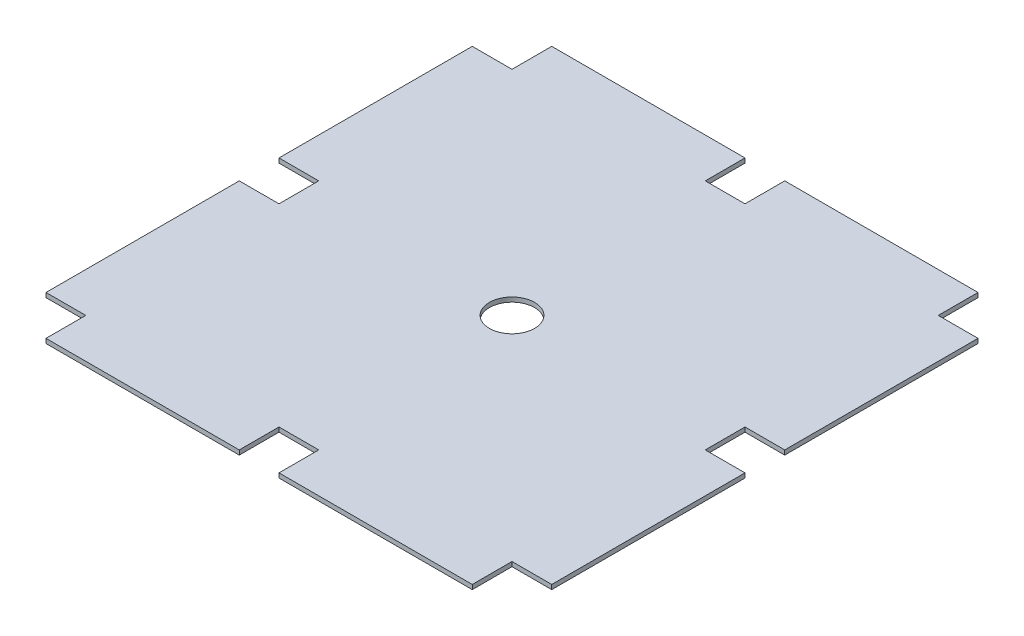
ISO-10303-21;
HEADER;
FILE_DESCRIPTION(('STEP AP214'),'2;1');
FILE_NAME('part.step','',(''),(''),'','','');
FILE_SCHEMA(('AUTOMOTIVE_DESIGN { 1 0 10303 214 1 1 1 1 }'));
ENDSEC;
DATA;
#1=APPLICATION_CONTEXT('core data for automotive mechanical design processes');
#2=APPLICATION_PROTOCOL_DEFINITION('international standard','automotive_design',2000,#1);
#3=PRODUCT_CONTEXT('',#1,'mechanical');
#4=PRODUCT('Part','Part','',(#3));
#5=PRODUCT_RELATED_PRODUCT_CATEGORY('part','',(#4));
#6=PRODUCT_DEFINITION_FORMATION('','',#4);
#7=PRODUCT_DEFINITION_CONTEXT('part definition',#1,'design');
#8=PRODUCT_DEFINITION('design','',#6,#7);
#9=PRODUCT_DEFINITION_SHAPE('','',#8);
#10=(LENGTH_UNIT() NAMED_UNIT(*) SI_UNIT(.MILLI.,.METRE.));
#11=(NAMED_UNIT(*) PLANE_ANGLE_UNIT() SI_UNIT($,.RADIAN.));
#12=(NAMED_UNIT(*) SI_UNIT($,.STERADIAN.) SOLID_ANGLE_UNIT());
#13=UNCERTAINTY_MEASURE_WITH_UNIT(LENGTH_MEASURE(1.E-05),#10,'distance_accuracy_value','');
#14=(GEOMETRIC_REPRESENTATION_CONTEXT(3) GLOBAL_UNCERTAINTY_ASSIGNED_CONTEXT((#13)) GLOBAL_UNIT_ASSIGNED_CONTEXT((#10,
#11,#12)) REPRESENTATION_CONTEXT('',''));
#15=CARTESIAN_POINT('',(0.,0.,0.));
#16=DIRECTION('',(0.,0.,1.));
#17=DIRECTION('',(1.,0.,0.));
#18=AXIS2_PLACEMENT_3D('',#15,#16,#17);
#19=CARTESIAN_POINT('',(-2.97741629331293E-13,3.175,-149.86));
#20=DIRECTION('',(0.,0.,-1.));
#21=DIRECTION('',(-1.,0.,0.));
#22=AXIS2_PLACEMENT_3D('',#19,#20,#21);
#23=PLANE('',#22);
#24=DIRECTION('',(1.,0.,0.));
#25=VECTOR('',#24,1.);
#26=CARTESIAN_POINT('',(-2.97741629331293E-13,0.,-149.86));
#27=LINE('',#26,#25);
#28=CARTESIAN_POINT('',(-13.97,0.,-149.86));
#29=VERTEX_POINT('',#28);
#30=CARTESIAN_POINT('',(13.97,0.,-149.86));
#31=VERTEX_POINT('',#30);
#32=EDGE_CURVE('E333',#29,#31,#27,.T.);
#33=ORIENTED_EDGE('',*,*,#32,.F.);
#34=DIRECTION('',(0.,-1.,0.));
#35=VECTOR('',#34,1.);
#36=CARTESIAN_POINT('',(-13.97,3.175,-149.86));
#37=LINE('',#36,#35);
#38=CARTESIAN_POINT('',(-13.97,3.175,-149.86));
#39=VERTEX_POINT('',#38);
#40=EDGE_CURVE('E11',#39,#29,#37,.T.);
#41=ORIENTED_EDGE('',*,*,#40,.F.);
#42=DIRECTION('',(1.,0.,0.));
#43=VECTOR('',#42,1.);
#44=CARTESIAN_POINT('',(-2.97741629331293E-13,3.175,-149.86));
#45=LINE('',#44,#43);
#46=CARTESIAN_POINT('',(13.97,3.175,-149.86));
#47=VERTEX_POINT('',#46);
#48=EDGE_CURVE('E255',#39,#47,#45,.T.);
#49=ORIENTED_EDGE('',*,*,#48,.T.);
#50=DIRECTION('',(0.,-1.,0.));
#51=VECTOR('',#50,1.);
#52=CARTESIAN_POINT('',(13.97,3.175,-149.86));
#53=LINE('',#52,#51);
#54=EDGE_CURVE('E145',#47,#31,#53,.T.);
#55=ORIENTED_EDGE('',*,*,#54,.T.);
#56=EDGE_LOOP('',(#33,#41,#49,#55));
#57=FACE_BOUND('',#56,.T.);
#58=ADVANCED_FACE('F34',(#57),#23,.T.);
#59=CARTESIAN_POINT('',(-13.9699999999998,3.175,0.));
#60=DIRECTION('',(1.,0.,0.));
#61=DIRECTION('',(0.,0.,-1.));
#62=AXIS2_PLACEMENT_3D('',#59,#60,#61);
#63=PLANE('',#62);
#64=DIRECTION('',(0.,0.,1.));
#65=VECTOR('',#64,1.);
#66=CARTESIAN_POINT('',(-13.9699999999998,0.,0.));
#67=LINE('',#66,#65);
#68=CARTESIAN_POINT('',(-13.97,0.,-177.8));
#69=VERTEX_POINT('',#68);
#70=EDGE_CURVE('E330',#69,#29,#67,.T.);
#71=ORIENTED_EDGE('',*,*,#70,.F.);
#72=DIRECTION('',(0.,-1.,0.));
#73=VECTOR('',#72,1.);
#74=CARTESIAN_POINT('',(-13.97,3.175,-177.8));
#75=LINE('',#74,#73);
#76=CARTESIAN_POINT('',(-13.97,3.175,-177.8));
#77=VERTEX_POINT('',#76);
#78=EDGE_CURVE('E43',#77,#69,#75,.T.);
#79=ORIENTED_EDGE('',*,*,#78,.F.);
#80=DIRECTION('',(0.,0.,1.));
#81=VECTOR('',#80,1.);
#82=CARTESIAN_POINT('',(-13.9699999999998,3.175,0.));
#83=LINE('',#82,#81);
#84=EDGE_CURVE('E250',#77,#39,#83,.T.);
#85=ORIENTED_EDGE('',*,*,#84,.T.);
#86=ORIENTED_EDGE('',*,*,#40,.T.);
#87=EDGE_LOOP('',(#71,#79,#85,#86));
#88=FACE_BOUND('',#87,.T.);
#89=ADVANCED_FACE('F331',(#88),#63,.T.);
#90=CARTESIAN_POINT('',(0.,3.175,-177.8));
#91=DIRECTION('',(0.,0.,-1.));
#92=DIRECTION('',(-1.,0.,0.));
#93=AXIS2_PLACEMENT_3D('',#90,#91,#92);
#94=PLANE('',#93);
#95=DIRECTION('',(1.,0.,0.));
#96=VECTOR('',#95,1.);
#97=CARTESIAN_POINT('',(0.,0.,-177.8));
#98=LINE('',#97,#96);
#99=CARTESIAN_POINT('',(-149.86,0.,-177.8));
#100=VERTEX_POINT('',#99);
#101=EDGE_CURVE('E269',#100,#69,#98,.T.);
#102=ORIENTED_EDGE('',*,*,#101,.F.);
#103=DIRECTION('',(0.,-1.,0.));
#104=VECTOR('',#103,1.);
#105=CARTESIAN_POINT('',(-149.86,3.175,-177.8));
#106=LINE('',#105,#104);
#107=CARTESIAN_POINT('',(-149.86,3.175,-177.8));
#108=VERTEX_POINT('',#107);
#109=EDGE_CURVE('E324',#108,#100,#106,.T.);
#110=ORIENTED_EDGE('',*,*,#109,.F.);
#111=DIRECTION('',(1.,0.,0.));
#112=VECTOR('',#111,1.);
#113=CARTESIAN_POINT('',(0.,3.175,-177.8));
#114=LINE('',#113,#112);
#115=EDGE_CURVE('E244',#108,#77,#114,.T.);
#116=ORIENTED_EDGE('',*,*,#115,.T.);
#117=ORIENTED_EDGE('',*,*,#78,.T.);
#118=EDGE_LOOP('',(#102,#110,#116,#117));
#119=FACE_BOUND('',#118,.T.);
#120=ADVANCED_FACE('F327',(#119),#94,.T.);
#121=CARTESIAN_POINT('',(-149.86,3.175,0.));
#122=DIRECTION('',(1.,0.,0.));
#123=DIRECTION('',(0.,0.,-1.));
#124=AXIS2_PLACEMENT_3D('',#121,#122,#123);
#125=PLANE('',#124);
#126=DIRECTION('',(0.,0.,1.));
#127=VECTOR('',#126,1.);
#128=CARTESIAN_POINT('',(-149.86,0.,0.));
#129=LINE('',#128,#127);
#130=CARTESIAN_POINT('',(-149.86,0.,-149.86));
#131=VERTEX_POINT('',#130);
#132=EDGE_CURVE('E339',#100,#131,#129,.T.);
#133=ORIENTED_EDGE('',*,*,#132,.T.);
#134=DIRECTION('',(0.,-1.,0.));
#135=VECTOR('',#134,1.);
#136=CARTESIAN_POINT('',(-149.86,3.175,-149.86));
#137=LINE('',#136,#135);
#138=CARTESIAN_POINT('',(-149.86,3.175,-149.86));
#139=VERTEX_POINT('',#138);
#140=EDGE_CURVE('E322',#139,#131,#137,.T.);
#141=ORIENTED_EDGE('',*,*,#140,.F.);
#142=DIRECTION('',(0.,0.,1.));
#143=VECTOR('',#142,1.);
#144=CARTESIAN_POINT('',(-149.86,3.175,0.));
#145=LINE('',#144,#143);
#146=EDGE_CURVE('E249',#108,#139,#145,.T.);
#147=ORIENTED_EDGE('',*,*,#146,.F.);
#148=ORIENTED_EDGE('',*,*,#109,.T.);
#149=EDGE_LOOP('',(#133,#141,#147,#148));
#150=FACE_BOUND('',#149,.T.);
#151=ADVANCED_FACE('F543',(#150),#125,.F.);
#152=CARTESIAN_POINT('',(1.48870814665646E-13,3.175,-149.86));
#153=DIRECTION('',(0.,0.,-1.));
#154=DIRECTION('',(-1.,0.,0.));
#155=AXIS2_PLACEMENT_3D('',#152,#153,#154);
#156=PLANE('',#155);
#157=DIRECTION('',(1.,0.,0.));
#158=VECTOR('',#157,1.);
#159=CARTESIAN_POINT('',(1.48870814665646E-13,0.,-149.86));
#160=LINE('',#159,#158);
#161=CARTESIAN_POINT('',(-177.8,0.,-149.86));
#162=VERTEX_POINT('',#161);
#163=EDGE_CURVE('E340',#162,#131,#160,.T.);
#164=ORIENTED_EDGE('',*,*,#163,.F.);
#165=DIRECTION('',(0.,-1.,0.));
#166=VECTOR('',#165,1.);
#167=CARTESIAN_POINT('',(-177.8,3.175,-149.86));
#168=LINE('',#167,#166);
#169=CARTESIAN_POINT('',(-177.8,3.175,-149.86));
#170=VERTEX_POINT('',#169);
#171=EDGE_CURVE('E320',#170,#162,#168,.T.);
#172=ORIENTED_EDGE('',*,*,#171,.F.);
#173=DIRECTION('',(1.,0.,0.));
#174=VECTOR('',#173,1.);
#175=CARTESIAN_POINT('',(1.48870814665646E-13,3.175,-149.86));
#176=LINE('',#175,#174);
#177=EDGE_CURVE('E253',#170,#139,#176,.T.);
#178=ORIENTED_EDGE('',*,*,#177,.T.);
#179=ORIENTED_EDGE('',*,*,#140,.T.);
#180=EDGE_LOOP('',(#164,#172,#178,#179));
#181=FACE_BOUND('',#180,.T.);
#182=ADVANCED_FACE('F463',(#181),#156,.T.);
#183=CARTESIAN_POINT('',(-177.8,3.175,0.));
#184=DIRECTION('',(-1.,0.,0.));
#185=DIRECTION('',(0.,0.,1.));
#186=AXIS2_PLACEMENT_3D('',#183,#184,#185);
#187=PLANE('',#186);
#188=DIRECTION('',(0.,0.,-1.));
#189=VECTOR('',#188,1.);
#190=CARTESIAN_POINT('',(-177.8,0.,0.));
#191=LINE('',#190,#189);
#192=CARTESIAN_POINT('',(-177.8,0.,-13.97));
#193=VERTEX_POINT('',#192);
#194=EDGE_CURVE('E345',#193,#162,#191,.T.);
#195=ORIENTED_EDGE('',*,*,#194,.F.);
#196=DIRECTION('',(0.,-1.,0.));
#197=VECTOR('',#196,1.);
#198=CARTESIAN_POINT('',(-177.8,3.175,-13.97));
#199=LINE('',#198,#197);
#200=CARTESIAN_POINT('',(-177.8,3.175,-13.97));
#201=VERTEX_POINT('',#200);
#202=EDGE_CURVE('E318',#201,#193,#199,.T.);
#203=ORIENTED_EDGE('',*,*,#202,.F.);
#204=DIRECTION('',(0.,0.,-1.));
#205=VECTOR('',#204,1.);
#206=CARTESIAN_POINT('',(-177.8,3.175,0.));
#207=LINE('',#206,#205);
#208=EDGE_CURVE('E456',#201,#170,#207,.T.);
#209=ORIENTED_EDGE('',*,*,#208,.T.);
#210=ORIENTED_EDGE('',*,*,#171,.T.);
#211=EDGE_LOOP('',(#195,#203,#209,#210));
#212=FACE_BOUND('',#211,.T.);
#213=ADVANCED_FACE('F469',(#212),#187,.T.);
#214=CARTESIAN_POINT('',(0.,3.175,-13.97));
#215=DIRECTION('',(0.,0.,-1.));
#216=DIRECTION('',(-1.,0.,0.));
#217=AXIS2_PLACEMENT_3D('',#214,#215,#216);
#218=PLANE('',#217);
#219=DIRECTION('',(1.,0.,0.));
#220=VECTOR('',#219,1.);
#221=CARTESIAN_POINT('',(0.,0.,-13.97));
#222=LINE('',#221,#220);
#223=CARTESIAN_POINT('',(-149.86,0.,-13.97));
#224=VERTEX_POINT('',#223);
#225=EDGE_CURVE('E348',#193,#224,#222,.T.);
#226=ORIENTED_EDGE('',*,*,#225,.T.);
#227=DIRECTION('',(0.,-1.,0.));
#228=VECTOR('',#227,1.);
#229=CARTESIAN_POINT('',(-149.86,3.175,-13.97));
#230=LINE('',#229,#228);
#231=CARTESIAN_POINT('',(-149.86,3.175,-13.97));
#232=VERTEX_POINT('',#231);
#233=EDGE_CURVE('E315',#232,#224,#230,.T.);
#234=ORIENTED_EDGE('',*,*,#233,.F.);
#235=DIRECTION('',(1.,0.,0.));
#236=VECTOR('',#235,1.);
#237=CARTESIAN_POINT('',(0.,3.175,-13.97));
#238=LINE('',#237,#236);
#239=EDGE_CURVE('E453',#201,#232,#238,.T.);
#240=ORIENTED_EDGE('',*,*,#239,.F.);
#241=ORIENTED_EDGE('',*,*,#202,.T.);
#242=EDGE_LOOP('',(#226,#234,#240,#241));
#243=FACE_BOUND('',#242,.T.);
#244=ADVANCED_FACE('F474',(#243),#218,.F.);
#245=CARTESIAN_POINT('',(-149.86,3.175,0.));
#246=DIRECTION('',(1.,0.,0.));
#247=DIRECTION('',(0.,0.,-1.));
#248=AXIS2_PLACEMENT_3D('',#245,#246,#247);
#249=PLANE('',#248);
#250=DIRECTION('',(0.,0.,1.));
#251=VECTOR('',#250,1.);
#252=CARTESIAN_POINT('',(-149.86,0.,0.));
#253=LINE('',#252,#251);
#254=CARTESIAN_POINT('',(-149.86,0.,13.97));
#255=VERTEX_POINT('',#254);
#256=EDGE_CURVE('E352',#224,#255,#253,.T.);
#257=ORIENTED_EDGE('',*,*,#256,.T.);
#258=DIRECTION('',(0.,-1.,0.));
#259=VECTOR('',#258,1.);
#260=CARTESIAN_POINT('',(-149.86,3.175,13.97));
#261=LINE('',#260,#259);
#262=CARTESIAN_POINT('',(-149.86,3.175,13.97));
#263=VERTEX_POINT('',#262);
#264=EDGE_CURVE('E313',#263,#255,#261,.T.);
#265=ORIENTED_EDGE('',*,*,#264,.F.);
#266=DIRECTION('',(0.,0.,1.));
#267=VECTOR('',#266,1.);
#268=CARTESIAN_POINT('',(-149.86,3.175,0.));
#269=LINE('',#268,#267);
#270=EDGE_CURVE('E451',#232,#263,#269,.T.);
#271=ORIENTED_EDGE('',*,*,#270,.F.);
#272=ORIENTED_EDGE('',*,*,#233,.T.);
#273=EDGE_LOOP('',(#257,#265,#271,#272));
#274=FACE_BOUND('',#273,.T.);
#275=ADVANCED_FACE('F480',(#274),#249,.F.);
#276=CARTESIAN_POINT('',(0.,3.175,13.97));
#277=DIRECTION('',(0.,0.,-1.));
#278=DIRECTION('',(-1.,0.,0.));
#279=AXIS2_PLACEMENT_3D('',#276,#277,#278);
#280=PLANE('',#279);
#281=DIRECTION('',(1.,0.,0.));
#282=VECTOR('',#281,1.);
#283=CARTESIAN_POINT('',(0.,0.,13.97));
#284=LINE('',#283,#282);
#285=CARTESIAN_POINT('',(-177.8,0.,13.97));
#286=VERTEX_POINT('',#285);
#287=EDGE_CURVE('E355',#286,#255,#284,.T.);
#288=ORIENTED_EDGE('',*,*,#287,.F.);
#289=DIRECTION('',(0.,-1.,0.));
#290=VECTOR('',#289,1.);
#291=CARTESIAN_POINT('',(-177.8,3.175,13.97));
#292=LINE('',#291,#290);
#293=CARTESIAN_POINT('',(-177.8,3.175,13.97));
#294=VERTEX_POINT('',#293);
#295=EDGE_CURVE('E311',#294,#286,#292,.T.);
#296=ORIENTED_EDGE('',*,*,#295,.F.);
#297=DIRECTION('',(1.,0.,0.));
#298=VECTOR('',#297,1.);
#299=CARTESIAN_POINT('',(0.,3.175,13.97));
#300=LINE('',#299,#298);
#301=EDGE_CURVE('E448',#294,#263,#300,.T.);
#302=ORIENTED_EDGE('',*,*,#301,.T.);
#303=ORIENTED_EDGE('',*,*,#264,.T.);
#304=EDGE_LOOP('',(#288,#296,#302,#303));
#305=FACE_BOUND('',#304,.T.);
#306=ADVANCED_FACE('F483',(#305),#280,.T.);
#307=CARTESIAN_POINT('',(-177.8,0.,149.86));
#308=VERTEX_POINT('',#307);
#309=EDGE_CURVE('E349',#308,#286,#191,.T.);
#310=ORIENTED_EDGE('',*,*,#309,.F.);
#311=DIRECTION('',(0.,-1.,0.));
#312=VECTOR('',#311,1.);
#313=CARTESIAN_POINT('',(-177.8,3.175,149.86));
#314=LINE('',#313,#312);
#315=CARTESIAN_POINT('',(-177.8,3.175,149.86));
#316=VERTEX_POINT('',#315);
#317=EDGE_CURVE('E309',#316,#308,#314,.T.);
#318=ORIENTED_EDGE('',*,*,#317,.F.);
#319=EDGE_CURVE('E447',#316,#294,#207,.T.);
#320=ORIENTED_EDGE('',*,*,#319,.T.);
#321=ORIENTED_EDGE('',*,*,#295,.T.);
#322=EDGE_LOOP('',(#310,#318,#320,#321));
#323=FACE_BOUND('',#322,.T.);
#324=ADVANCED_FACE('F487',(#323),#187,.T.);
#325=CARTESIAN_POINT('',(1.48870814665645E-13,3.175,149.86));
#326=DIRECTION('',(0.,0.,-1.));
#327=DIRECTION('',(-1.,0.,0.));
#328=AXIS2_PLACEMENT_3D('',#325,#326,#327);
#329=PLANE('',#328);
#330=DIRECTION('',(1.,0.,0.));
#331=VECTOR('',#330,1.);
#332=CARTESIAN_POINT('',(1.48870814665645E-13,0.,149.86));
#333=LINE('',#332,#331);
#334=CARTESIAN_POINT('',(-149.86,0.,149.86));
#335=VERTEX_POINT('',#334);
#336=EDGE_CURVE('E358',#308,#335,#333,.T.);
#337=ORIENTED_EDGE('',*,*,#336,.T.);
#338=DIRECTION('',(0.,-1.,0.));
#339=VECTOR('',#338,1.);
#340=CARTESIAN_POINT('',(-149.86,3.175,149.86));
#341=LINE('',#340,#339);
#342=CARTESIAN_POINT('',(-149.86,3.175,149.86));
#343=VERTEX_POINT('',#342);
#344=EDGE_CURVE('E307',#343,#335,#341,.T.);
#345=ORIENTED_EDGE('',*,*,#344,.F.);
#346=DIRECTION('',(1.,0.,0.));
#347=VECTOR('',#346,1.);
#348=CARTESIAN_POINT('',(1.48870814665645E-13,3.175,149.86));
#349=LINE('',#348,#347);
#350=EDGE_CURVE('E445',#316,#343,#349,.T.);
#351=ORIENTED_EDGE('',*,*,#350,.F.);
#352=ORIENTED_EDGE('',*,*,#317,.T.);
#353=EDGE_LOOP('',(#337,#345,#351,#352));
#354=FACE_BOUND('',#353,.T.);
#355=ADVANCED_FACE('F492',(#354),#329,.F.);
#356=CARTESIAN_POINT('',(-149.86,3.175,0.));
#357=DIRECTION('',(-1.,0.,0.));
#358=DIRECTION('',(0.,0.,1.));
#359=AXIS2_PLACEMENT_3D('',#356,#357,#358);
#360=PLANE('',#359);
#361=DIRECTION('',(0.,0.,-1.));
#362=VECTOR('',#361,1.);
#363=CARTESIAN_POINT('',(-149.86,0.,0.));
#364=LINE('',#363,#362);
#365=CARTESIAN_POINT('',(-149.86,0.,177.8));
#366=VERTEX_POINT('',#365);
#367=EDGE_CURVE('E361',#366,#335,#364,.T.);
#368=ORIENTED_EDGE('',*,*,#367,.F.);
#369=DIRECTION('',(0.,-1.,0.));
#370=VECTOR('',#369,1.);
#371=CARTESIAN_POINT('',(-149.86,3.175,177.8));
#372=LINE('',#371,#370);
#373=CARTESIAN_POINT('',(-149.86,3.175,177.8));
#374=VERTEX_POINT('',#373);
#375=EDGE_CURVE('E305',#374,#366,#372,.T.);
#376=ORIENTED_EDGE('',*,*,#375,.F.);
#377=DIRECTION('',(0.,0.,-1.));
#378=VECTOR('',#377,1.);
#379=CARTESIAN_POINT('',(-149.86,3.175,0.));
#380=LINE('',#379,#378);
#381=EDGE_CURVE('E442',#374,#343,#380,.T.);
#382=ORIENTED_EDGE('',*,*,#381,.T.);
#383=ORIENTED_EDGE('',*,*,#344,.T.);
#384=EDGE_LOOP('',(#368,#376,#382,#383));
#385=FACE_BOUND('',#384,.T.);
#386=ADVANCED_FACE('F496',(#385),#360,.T.);
#387=CARTESIAN_POINT('',(0.,3.175,177.8));
#388=DIRECTION('',(0.,0.,-1.));
#389=DIRECTION('',(-1.,0.,0.));
#390=AXIS2_PLACEMENT_3D('',#387,#388,#389);
#391=PLANE('',#390);
#392=DIRECTION('',(1.,0.,0.));
#393=VECTOR('',#392,1.);
#394=CARTESIAN_POINT('',(0.,0.,177.8));
#395=LINE('',#394,#393);
#396=CARTESIAN_POINT('',(-13.97,0.,177.8));
#397=VERTEX_POINT('',#396);
#398=EDGE_CURVE('E364',#366,#397,#395,.T.);
#399=ORIENTED_EDGE('',*,*,#398,.T.);
#400=DIRECTION('',(0.,-1.,0.));
#401=VECTOR('',#400,1.);
#402=CARTESIAN_POINT('',(-13.97,3.175,177.8));
#403=LINE('',#402,#401);
#404=CARTESIAN_POINT('',(-13.97,3.175,177.8));
#405=VERTEX_POINT('',#404);
#406=EDGE_CURVE('E303',#405,#397,#403,.T.);
#407=ORIENTED_EDGE('',*,*,#406,.F.);
#408=DIRECTION('',(1.,0.,0.));
#409=VECTOR('',#408,1.);
#410=CARTESIAN_POINT('',(0.,3.175,177.8));
#411=LINE('',#410,#409);
#412=EDGE_CURVE('E440',#374,#405,#411,.T.);
#413=ORIENTED_EDGE('',*,*,#412,.F.);
#414=ORIENTED_EDGE('',*,*,#375,.T.);
#415=EDGE_LOOP('',(#399,#407,#413,#414));
#416=FACE_BOUND('',#415,.T.);
#417=ADVANCED_FACE('F501',(#416),#391,.F.);
#418=CARTESIAN_POINT('',(-13.97,3.175,0.));
#419=DIRECTION('',(1.,0.,0.));
#420=DIRECTION('',(0.,0.,-1.));
#421=AXIS2_PLACEMENT_3D('',#418,#419,#420);
#422=PLANE('',#421);
#423=DIRECTION('',(0.,0.,1.));
#424=VECTOR('',#423,1.);
#425=CARTESIAN_POINT('',(-13.97,0.,0.));
#426=LINE('',#425,#424);
#427=CARTESIAN_POINT('',(-13.97,0.,149.86));
#428=VERTEX_POINT('',#427);
#429=EDGE_CURVE('E367',#428,#397,#426,.T.);
#430=ORIENTED_EDGE('',*,*,#429,.F.);
#431=DIRECTION('',(0.,-1.,0.));
#432=VECTOR('',#431,1.);
#433=CARTESIAN_POINT('',(-13.97,3.175,149.86));
#434=LINE('',#433,#432);
#435=CARTESIAN_POINT('',(-13.97,3.175,149.86));
#436=VERTEX_POINT('',#435);
#437=EDGE_CURVE('E301',#436,#428,#434,.T.);
#438=ORIENTED_EDGE('',*,*,#437,.F.);
#439=DIRECTION('',(0.,0.,1.));
#440=VECTOR('',#439,1.);
#441=CARTESIAN_POINT('',(-13.97,3.175,0.));
#442=LINE('',#441,#440);
#443=EDGE_CURVE('E437',#436,#405,#442,.T.);
#444=ORIENTED_EDGE('',*,*,#443,.T.);
#445=ORIENTED_EDGE('',*,*,#406,.T.);
#446=EDGE_LOOP('',(#430,#438,#444,#445));
#447=FACE_BOUND('',#446,.T.);
#448=ADVANCED_FACE('F507',(#447),#422,.T.);
#449=CARTESIAN_POINT('',(0.,3.175,149.86));
#450=DIRECTION('',(0.,0.,-1.));
#451=DIRECTION('',(-1.,0.,0.));
#452=AXIS2_PLACEMENT_3D('',#449,#450,#451);
#453=PLANE('',#452);
#454=DIRECTION('',(1.,0.,0.));
#455=VECTOR('',#454,1.);
#456=CARTESIAN_POINT('',(0.,0.,149.86));
#457=LINE('',#456,#455);
#458=CARTESIAN_POINT('',(13.97,0.,149.86));
#459=VERTEX_POINT('',#458);
#460=EDGE_CURVE('E371',#428,#459,#457,.T.);
#461=ORIENTED_EDGE('',*,*,#460,.T.);
#462=DIRECTION('',(0.,-1.,0.));
#463=VECTOR('',#462,1.);
#464=CARTESIAN_POINT('',(13.97,3.175,149.86));
#465=LINE('',#464,#463);
#466=CARTESIAN_POINT('',(13.97,3.175,149.86));
#467=VERTEX_POINT('',#466);
#468=EDGE_CURVE('E298',#467,#459,#465,.T.);
#469=ORIENTED_EDGE('',*,*,#468,.F.);
#470=DIRECTION('',(1.,0.,0.));
#471=VECTOR('',#470,1.);
#472=CARTESIAN_POINT('',(0.,3.175,149.86));
#473=LINE('',#472,#471);
#474=EDGE_CURVE('E434',#436,#467,#473,.T.);
#475=ORIENTED_EDGE('',*,*,#474,.F.);
#476=ORIENTED_EDGE('',*,*,#437,.T.);
#477=EDGE_LOOP('',(#461,#469,#475,#476));
#478=FACE_BOUND('',#477,.T.);
#479=ADVANCED_FACE('F510',(#478),#453,.F.);
#480=CARTESIAN_POINT('',(13.97,3.175,0.));
#481=DIRECTION('',(1.,0.,0.));
#482=DIRECTION('',(0.,0.,-1.));
#483=AXIS2_PLACEMENT_3D('',#480,#481,#482);
#484=PLANE('',#483);
#485=DIRECTION('',(0.,0.,1.));
#486=VECTOR('',#485,1.);
#487=CARTESIAN_POINT('',(13.97,0.,0.));
#488=LINE('',#487,#486);
#489=CARTESIAN_POINT('',(13.97,0.,177.8));
#490=VERTEX_POINT('',#489);
#491=EDGE_CURVE('E374',#459,#490,#488,.T.);
#492=ORIENTED_EDGE('',*,*,#491,.T.);
#493=DIRECTION('',(0.,-1.,0.));
#494=VECTOR('',#493,1.);
#495=CARTESIAN_POINT('',(13.97,3.175,177.8));
#496=LINE('',#495,#494);
#497=CARTESIAN_POINT('',(13.97,3.175,177.8));
#498=VERTEX_POINT('',#497);
#499=EDGE_CURVE('E295',#498,#490,#496,.T.);
#500=ORIENTED_EDGE('',*,*,#499,.F.);
#501=DIRECTION('',(0.,0.,1.));
#502=VECTOR('',#501,1.);
#503=CARTESIAN_POINT('',(13.97,3.175,0.));
#504=LINE('',#503,#502);
#505=EDGE_CURVE('E431',#467,#498,#504,.T.);
#506=ORIENTED_EDGE('',*,*,#505,.F.);
#507=ORIENTED_EDGE('',*,*,#468,.T.);
#508=EDGE_LOOP('',(#492,#500,#506,#507));
#509=FACE_BOUND('',#508,.T.);
#510=ADVANCED_FACE('F512',(#509),#484,.F.);
#511=CARTESIAN_POINT('',(149.86,0.,177.8));
#512=VERTEX_POINT('',#511);
#513=EDGE_CURVE('E368',#490,#512,#395,.T.);
#514=ORIENTED_EDGE('',*,*,#513,.T.);
#515=DIRECTION('',(0.,-1.,0.));
#516=VECTOR('',#515,1.);
#517=CARTESIAN_POINT('',(149.86,3.175,177.8));
#518=LINE('',#517,#516);
#519=CARTESIAN_POINT('',(149.86,3.175,177.8));
#520=VERTEX_POINT('',#519);
#521=EDGE_CURVE('E292',#520,#512,#518,.T.);
#522=ORIENTED_EDGE('',*,*,#521,.F.);
#523=EDGE_CURVE('E428',#498,#520,#411,.T.);
#524=ORIENTED_EDGE('',*,*,#523,.F.);
#525=ORIENTED_EDGE('',*,*,#499,.T.);
#526=EDGE_LOOP('',(#514,#522,#524,#525));
#527=FACE_BOUND('',#526,.T.);
#528=ADVANCED_FACE('F519',(#527),#391,.F.);
#529=CARTESIAN_POINT('',(149.86,3.175,0.));
#530=DIRECTION('',(-1.,0.,0.));
#531=DIRECTION('',(0.,0.,1.));
#532=AXIS2_PLACEMENT_3D('',#529,#530,#531);
#533=PLANE('',#532);
#534=DIRECTION('',(0.,0.,-1.));
#535=VECTOR('',#534,1.);
#536=CARTESIAN_POINT('',(149.86,0.,0.));
#537=LINE('',#536,#535);
#538=CARTESIAN_POINT('',(149.86,0.,149.86));
#539=VERTEX_POINT('',#538);
#540=EDGE_CURVE('E377',#512,#539,#537,.T.);
#541=ORIENTED_EDGE('',*,*,#540,.T.);
#542=DIRECTION('',(0.,-1.,0.));
#543=VECTOR('',#542,1.);
#544=CARTESIAN_POINT('',(149.86,3.175,149.86));
#545=LINE('',#544,#543);
#546=CARTESIAN_POINT('',(149.86,3.175,149.86));
#547=VERTEX_POINT('',#546);
#548=EDGE_CURVE('E290',#547,#539,#545,.T.);
#549=ORIENTED_EDGE('',*,*,#548,.F.);
#550=DIRECTION('',(0.,0.,-1.));
#551=VECTOR('',#550,1.);
#552=CARTESIAN_POINT('',(149.86,3.175,0.));
#553=LINE('',#552,#551);
#554=EDGE_CURVE('E426',#520,#547,#553,.T.);
#555=ORIENTED_EDGE('',*,*,#554,.F.);
#556=ORIENTED_EDGE('',*,*,#521,.T.);
#557=EDGE_LOOP('',(#541,#549,#555,#556));
#558=FACE_BOUND('',#557,.T.);
#559=ADVANCED_FACE('F521',(#558),#533,.F.);
#560=CARTESIAN_POINT('',(0.,3.175,149.86));
#561=DIRECTION('',(0.,0.,1.));
#562=DIRECTION('',(1.,0.,0.));
#563=AXIS2_PLACEMENT_3D('',#560,#561,#562);
#564=PLANE('',#563);
#565=DIRECTION('',(-1.,0.,0.));
#566=VECTOR('',#565,1.);
#567=CARTESIAN_POINT('',(0.,0.,149.86));
#568=LINE('',#567,#566);
#569=CARTESIAN_POINT('',(177.8,0.,149.86));
#570=VERTEX_POINT('',#569);
#571=EDGE_CURVE('E380',#570,#539,#568,.T.);
#572=ORIENTED_EDGE('',*,*,#571,.F.);
#573=DIRECTION('',(0.,-1.,0.));
#574=VECTOR('',#573,1.);
#575=CARTESIAN_POINT('',(177.8,3.175,149.86));
#576=LINE('',#575,#574);
#577=CARTESIAN_POINT('',(177.8,3.175,149.86));
#578=VERTEX_POINT('',#577);
#579=EDGE_CURVE('E288',#578,#570,#576,.T.);
#580=ORIENTED_EDGE('',*,*,#579,.F.);
#581=DIRECTION('',(-1.,0.,0.));
#582=VECTOR('',#581,1.);
#583=CARTESIAN_POINT('',(0.,3.175,149.86));
#584=LINE('',#583,#582);
#585=EDGE_CURVE('E419',#578,#547,#584,.T.);
#586=ORIENTED_EDGE('',*,*,#585,.T.);
#587=ORIENTED_EDGE('',*,*,#548,.T.);
#588=EDGE_LOOP('',(#572,#580,#586,#587));
#589=FACE_BOUND('',#588,.T.);
#590=ADVANCED_FACE('F523',(#589),#564,.T.);
#591=CARTESIAN_POINT('',(177.8,3.175,0.));
#592=DIRECTION('',(-1.,0.,0.));
#593=DIRECTION('',(0.,0.,1.));
#594=AXIS2_PLACEMENT_3D('',#591,#592,#593);
#595=PLANE('',#594);
#596=DIRECTION('',(0.,0.,-1.));
#597=VECTOR('',#596,1.);
#598=CARTESIAN_POINT('',(177.8,0.,0.));
#599=LINE('',#598,#597);
#600=CARTESIAN_POINT('',(177.8,0.,13.9699999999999));
#601=VERTEX_POINT('',#600);
#602=EDGE_CURVE('E383',#570,#601,#599,.T.);
#603=ORIENTED_EDGE('',*,*,#602,.T.);
#604=DIRECTION('',(0.,-1.,0.));
#605=VECTOR('',#604,1.);
#606=CARTESIAN_POINT('',(177.8,3.175,13.9699999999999));
#607=LINE('',#606,#605);
#608=CARTESIAN_POINT('',(177.8,3.175,13.9699999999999));
#609=VERTEX_POINT('',#608);
#610=EDGE_CURVE('E286',#609,#601,#607,.T.);
#611=ORIENTED_EDGE('',*,*,#610,.F.);
#612=DIRECTION('',(0.,0.,-1.));
#613=VECTOR('',#612,1.);
#614=CARTESIAN_POINT('',(177.8,3.175,0.));
#615=LINE('',#614,#613);
#616=EDGE_CURVE('E413',#578,#609,#615,.T.);
#617=ORIENTED_EDGE('',*,*,#616,.F.);
#618=ORIENTED_EDGE('',*,*,#579,.T.);
#619=EDGE_LOOP('',(#603,#611,#617,#618));
#620=FACE_BOUND('',#619,.T.);
#621=ADVANCED_FACE('F527',(#620),#595,.F.);
#622=CARTESIAN_POINT('',(0.,3.175,13.9700000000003));
#623=DIRECTION('',(0.,0.,-1.));
#624=DIRECTION('',(-1.,0.,0.));
#625=AXIS2_PLACEMENT_3D('',#622,#623,#624);
#626=PLANE('',#625);
#627=DIRECTION('',(1.,0.,0.));
#628=VECTOR('',#627,1.);
#629=CARTESIAN_POINT('',(0.,0.,13.9700000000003));
#630=LINE('',#629,#628);
#631=CARTESIAN_POINT('',(149.86,0.,13.9699999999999));
#632=VERTEX_POINT('',#631);
#633=EDGE_CURVE('E386',#632,#601,#630,.T.);
#634=ORIENTED_EDGE('',*,*,#633,.F.);
#635=DIRECTION('',(0.,-1.,0.));
#636=VECTOR('',#635,1.);
#637=CARTESIAN_POINT('',(149.86,3.175,13.9699999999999));
#638=LINE('',#637,#636);
#639=CARTESIAN_POINT('',(149.86,3.175,13.9699999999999));
#640=VERTEX_POINT('',#639);
#641=EDGE_CURVE('E284',#640,#632,#638,.T.);
#642=ORIENTED_EDGE('',*,*,#641,.F.);
#643=DIRECTION('',(1.,0.,0.));
#644=VECTOR('',#643,1.);
#645=CARTESIAN_POINT('',(0.,3.175,13.9700000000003));
#646=LINE('',#645,#644);
#647=EDGE_CURVE('E418',#640,#609,#646,.T.);
#648=ORIENTED_EDGE('',*,*,#647,.T.);
#649=ORIENTED_EDGE('',*,*,#610,.T.);
#650=EDGE_LOOP('',(#634,#642,#648,#649));
#651=FACE_BOUND('',#650,.T.);
#652=ADVANCED_FACE('F529',(#651),#626,.T.);
#653=CARTESIAN_POINT('',(149.86,3.175,0.));
#654=DIRECTION('',(1.,0.,0.));
#655=DIRECTION('',(0.,0.,-1.));
#656=AXIS2_PLACEMENT_3D('',#653,#654,#655);
#657=PLANE('',#656);
#658=DIRECTION('',(0.,0.,1.));
#659=VECTOR('',#658,1.);
#660=CARTESIAN_POINT('',(149.86,0.,0.));
#661=LINE('',#660,#659);
#662=CARTESIAN_POINT('',(149.86,0.,-13.9700000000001));
#663=VERTEX_POINT('',#662);
#664=EDGE_CURVE('E390',#663,#632,#661,.T.);
#665=ORIENTED_EDGE('',*,*,#664,.F.);
#666=DIRECTION('',(0.,-1.,0.));
#667=VECTOR('',#666,1.);
#668=CARTESIAN_POINT('',(149.86,3.175,-13.9700000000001));
#669=LINE('',#668,#667);
#670=CARTESIAN_POINT('',(149.86,3.175,-13.9700000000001));
#671=VERTEX_POINT('',#670);
#672=EDGE_CURVE('E282',#671,#663,#669,.T.);
#673=ORIENTED_EDGE('',*,*,#672,.F.);
#674=DIRECTION('',(0.,0.,1.));
#675=VECTOR('',#674,1.);
#676=CARTESIAN_POINT('',(149.86,3.175,0.));
#677=LINE('',#676,#675);
#678=EDGE_CURVE('E414',#671,#640,#677,.T.);
#679=ORIENTED_EDGE('',*,*,#678,.T.);
#680=ORIENTED_EDGE('',*,*,#641,.T.);
#681=EDGE_LOOP('',(#665,#673,#679,#680));
#682=FACE_BOUND('',#681,.T.);
#683=ADVANCED_FACE('F532',(#682),#657,.T.);
#684=CARTESIAN_POINT('',(0.,3.175,-13.97));
#685=DIRECTION('',(0.,0.,-1.));
#686=DIRECTION('',(-1.,0.,0.));
#687=AXIS2_PLACEMENT_3D('',#684,#685,#686);
#688=PLANE('',#687);
#689=DIRECTION('',(1.,0.,0.));
#690=VECTOR('',#689,1.);
#691=CARTESIAN_POINT('',(0.,0.,-13.97));
#692=LINE('',#691,#690);
#693=CARTESIAN_POINT('',(177.8,0.,-13.9700000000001));
#694=VERTEX_POINT('',#693);
#695=EDGE_CURVE('E393',#663,#694,#692,.T.);
#696=ORIENTED_EDGE('',*,*,#695,.T.);
#697=DIRECTION('',(0.,-1.,0.));
#698=VECTOR('',#697,1.);
#699=CARTESIAN_POINT('',(177.8,3.175,-13.9700000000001));
#700=LINE('',#699,#698);
#701=CARTESIAN_POINT('',(177.8,3.175,-13.9700000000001));
#702=VERTEX_POINT('',#701);
#703=EDGE_CURVE('E279',#702,#694,#700,.T.);
#704=ORIENTED_EDGE('',*,*,#703,.F.);
#705=DIRECTION('',(1.,0.,0.));
#706=VECTOR('',#705,1.);
#707=CARTESIAN_POINT('',(0.,3.175,-13.97));
#708=LINE('',#707,#706);
#709=EDGE_CURVE('E411',#671,#702,#708,.T.);
#710=ORIENTED_EDGE('',*,*,#709,.F.);
#711=ORIENTED_EDGE('',*,*,#672,.T.);
#712=EDGE_LOOP('',(#696,#704,#710,#711));
#713=FACE_BOUND('',#712,.T.);
#714=ADVANCED_FACE('F577',(#713),#688,.F.);
#715=CARTESIAN_POINT('',(177.8,0.,-149.86));
#716=VERTEX_POINT('',#715);
#717=EDGE_CURVE('E387',#694,#716,#599,.T.);
#718=ORIENTED_EDGE('',*,*,#717,.T.);
#719=DIRECTION('',(0.,-1.,0.));
#720=VECTOR('',#719,1.);
#721=CARTESIAN_POINT('',(177.8,3.175,-149.86));
#722=LINE('',#721,#720);
#723=CARTESIAN_POINT('',(177.8,3.175,-149.86));
#724=VERTEX_POINT('',#723);
#725=EDGE_CURVE('E276',#724,#716,#722,.T.);
#726=ORIENTED_EDGE('',*,*,#725,.F.);
#727=EDGE_CURVE('E406',#702,#724,#615,.T.);
#728=ORIENTED_EDGE('',*,*,#727,.F.);
#729=ORIENTED_EDGE('',*,*,#703,.T.);
#730=EDGE_LOOP('',(#718,#726,#728,#729));
#731=FACE_BOUND('',#730,.T.);
#732=ADVANCED_FACE('F401',(#731),#595,.F.);
#733=CARTESIAN_POINT('',(0.,3.175,-149.86));
#734=DIRECTION('',(0.,0.,1.));
#735=DIRECTION('',(1.,0.,0.));
#736=AXIS2_PLACEMENT_3D('',#733,#734,#735);
#737=PLANE('',#736);
#738=DIRECTION('',(-1.,0.,0.));
#739=VECTOR('',#738,1.);
#740=CARTESIAN_POINT('',(0.,0.,-149.86));
#741=LINE('',#740,#739);
#742=CARTESIAN_POINT('',(149.86,0.,-149.86));
#743=VERTEX_POINT('',#742);
#744=EDGE_CURVE('E395',#716,#743,#741,.T.);
#745=ORIENTED_EDGE('',*,*,#744,.T.);
#746=DIRECTION('',(0.,-1.,0.));
#747=VECTOR('',#746,1.);
#748=CARTESIAN_POINT('',(149.86,3.175,-149.86));
#749=LINE('',#748,#747);
#750=CARTESIAN_POINT('',(149.86,3.175,-149.86));
#751=VERTEX_POINT('',#750);
#752=EDGE_CURVE('E234',#751,#743,#749,.T.);
#753=ORIENTED_EDGE('',*,*,#752,.F.);
#754=DIRECTION('',(-1.,0.,0.));
#755=VECTOR('',#754,1.);
#756=CARTESIAN_POINT('',(0.,3.175,-149.86));
#757=LINE('',#756,#755);
#758=EDGE_CURVE('E239',#724,#751,#757,.T.);
#759=ORIENTED_EDGE('',*,*,#758,.F.);
#760=ORIENTED_EDGE('',*,*,#725,.T.);
#761=EDGE_LOOP('',(#745,#753,#759,#760));
#762=FACE_BOUND('',#761,.T.);
#763=ADVANCED_FACE('F405',(#762),#737,.F.);
#764=CARTESIAN_POINT('',(149.86,3.175,0.));
#765=DIRECTION('',(1.,0.,0.));
#766=DIRECTION('',(0.,0.,-1.));
#767=AXIS2_PLACEMENT_3D('',#764,#765,#766);
#768=PLANE('',#767);
#769=DIRECTION('',(0.,0.,1.));
#770=VECTOR('',#769,1.);
#771=CARTESIAN_POINT('',(149.86,0.,0.));
#772=LINE('',#771,#770);
#773=CARTESIAN_POINT('',(149.86,0.,-177.8));
#774=VERTEX_POINT('',#773);
#775=EDGE_CURVE('E229',#774,#743,#772,.T.);
#776=ORIENTED_EDGE('',*,*,#775,.F.);
#777=DIRECTION('',(0.,-1.,0.));
#778=VECTOR('',#777,1.);
#779=CARTESIAN_POINT('',(149.86,3.175,-177.8));
#780=LINE('',#779,#778);
#781=CARTESIAN_POINT('',(149.86,3.175,-177.8));
#782=VERTEX_POINT('',#781);
#783=EDGE_CURVE('E224',#782,#774,#780,.T.);
#784=ORIENTED_EDGE('',*,*,#783,.F.);
#785=DIRECTION('',(0.,0.,1.));
#786=VECTOR('',#785,1.);
#787=CARTESIAN_POINT('',(149.86,3.175,0.));
#788=LINE('',#787,#786);
#789=EDGE_CURVE('E227',#782,#751,#788,.T.);
#790=ORIENTED_EDGE('',*,*,#789,.T.);
#791=ORIENTED_EDGE('',*,*,#752,.T.);
#792=EDGE_LOOP('',(#776,#784,#790,#791));
#793=FACE_BOUND('',#792,.T.);
#794=ADVANCED_FACE('F226',(#793),#768,.T.);
#795=CARTESIAN_POINT('',(13.97,0.,-177.8));
#796=VERTEX_POINT('',#795);
#797=EDGE_CURVE('E265',#796,#774,#98,.T.);
#798=ORIENTED_EDGE('',*,*,#797,.F.);
#799=DIRECTION('',(0.,-1.,0.));
#800=VECTOR('',#799,1.);
#801=CARTESIAN_POINT('',(13.97,3.175,-177.8));
#802=LINE('',#801,#800);
#803=CARTESIAN_POINT('',(13.97,3.175,-177.8));
#804=VERTEX_POINT('',#803);
#805=EDGE_CURVE('E138',#804,#796,#802,.T.);
#806=ORIENTED_EDGE('',*,*,#805,.F.);
#807=EDGE_CURVE('E237',#804,#782,#114,.T.);
#808=ORIENTED_EDGE('',*,*,#807,.T.);
#809=ORIENTED_EDGE('',*,*,#783,.T.);
#810=EDGE_LOOP('',(#798,#806,#808,#809));
#811=FACE_BOUND('',#810,.T.);
#812=ADVANCED_FACE('F242',(#811),#94,.T.);
#813=CARTESIAN_POINT('',(0.,3.175,0.));
#814=DIRECTION('',(0.,-1.,0.));
#815=DIRECTION('',(0.,0.,-1.));
#816=AXIS2_PLACEMENT_3D('',#813,#814,#815);
#817=CYLINDRICAL_SURFACE('',#816,15.875);
#818=CARTESIAN_POINT('',(0.,3.175,0.));
#819=DIRECTION('',(0.,1.,0.));
#820=DIRECTION('',(0.,0.,1.));
#821=AXIS2_PLACEMENT_3D('',#818,#819,#820);
#822=CIRCLE('',#821,15.875);
#823=CARTESIAN_POINT('',(0.,3.175,15.875));
#824=VERTEX_POINT('',#823);
#825=EDGE_CURVE('E258',#824,#824,#822,.T.);
#826=ORIENTED_EDGE('',*,*,#825,.T.);
#827=EDGE_LOOP('',(#826));
#828=FACE_BOUND('',#827,.T.);
#829=CARTESIAN_POINT('',(0.,0.,0.));
#830=DIRECTION('',(0.,1.,0.));
#831=DIRECTION('',(0.,0.,1.));
#832=AXIS2_PLACEMENT_3D('',#829,#830,#831);
#833=CIRCLE('',#832,15.875);
#834=CARTESIAN_POINT('',(0.,0.,15.875));
#835=VERTEX_POINT('',#834);
#836=EDGE_CURVE('E535',#835,#835,#833,.T.);
#837=ORIENTED_EDGE('',*,*,#836,.F.);
#838=EDGE_LOOP('',(#837));
#839=FACE_BOUND('',#838,.T.);
#840=ADVANCED_FACE('F36',(#828,#839),#817,.F.);
#841=CARTESIAN_POINT('',(13.97,3.175,0.));
#842=DIRECTION('',(1.,0.,0.));
#843=DIRECTION('',(0.,0.,-1.));
#844=AXIS2_PLACEMENT_3D('',#841,#842,#843);
#845=PLANE('',#844);
#846=DIRECTION('',(0.,0.,1.));
#847=VECTOR('',#846,1.);
#848=CARTESIAN_POINT('',(13.97,0.,0.));
#849=LINE('',#848,#847);
#850=EDGE_CURVE('E262',#796,#31,#849,.T.);
#851=ORIENTED_EDGE('',*,*,#850,.T.);
#852=ORIENTED_EDGE('',*,*,#54,.F.);
#853=DIRECTION('',(0.,0.,1.));
#854=VECTOR('',#853,1.);
#855=CARTESIAN_POINT('',(13.97,3.175,0.));
#856=LINE('',#855,#854);
#857=EDGE_CURVE('E51',#804,#47,#856,.T.);
#858=ORIENTED_EDGE('',*,*,#857,.F.);
#859=ORIENTED_EDGE('',*,*,#805,.T.);
#860=EDGE_LOOP('',(#851,#852,#858,#859));
#861=FACE_BOUND('',#860,.T.);
#862=ADVANCED_FACE('F589',(#861),#845,.F.);
#863=CARTESIAN_POINT('',(0.,3.175,0.));
#864=DIRECTION('',(0.,1.,0.));
#865=DIRECTION('',(0.,0.,1.));
#866=AXIS2_PLACEMENT_3D('',#863,#864,#865);
#867=PLANE('',#866);
#868=ORIENTED_EDGE('',*,*,#825,.F.);
#869=EDGE_LOOP('',(#868));
#870=FACE_BOUND('',#869,.T.);
#871=ORIENTED_EDGE('',*,*,#48,.F.);
#872=ORIENTED_EDGE('',*,*,#84,.F.);
#873=ORIENTED_EDGE('',*,*,#115,.F.);
#874=ORIENTED_EDGE('',*,*,#146,.T.);
#875=ORIENTED_EDGE('',*,*,#177,.F.);
#876=ORIENTED_EDGE('',*,*,#208,.F.);
#877=ORIENTED_EDGE('',*,*,#239,.T.);
#878=ORIENTED_EDGE('',*,*,#270,.T.);
#879=ORIENTED_EDGE('',*,*,#301,.F.);
#880=ORIENTED_EDGE('',*,*,#319,.F.);
#881=ORIENTED_EDGE('',*,*,#350,.T.);
#882=ORIENTED_EDGE('',*,*,#381,.F.);
#883=ORIENTED_EDGE('',*,*,#412,.T.);
#884=ORIENTED_EDGE('',*,*,#443,.F.);
#885=ORIENTED_EDGE('',*,*,#474,.T.);
#886=ORIENTED_EDGE('',*,*,#505,.T.);
#887=ORIENTED_EDGE('',*,*,#523,.T.);
#888=ORIENTED_EDGE('',*,*,#554,.T.);
#889=ORIENTED_EDGE('',*,*,#585,.F.);
#890=ORIENTED_EDGE('',*,*,#616,.T.);
#891=ORIENTED_EDGE('',*,*,#647,.F.);
#892=ORIENTED_EDGE('',*,*,#678,.F.);
#893=ORIENTED_EDGE('',*,*,#709,.T.);
#894=ORIENTED_EDGE('',*,*,#727,.T.);
#895=ORIENTED_EDGE('',*,*,#758,.T.);
#896=ORIENTED_EDGE('',*,*,#789,.F.);
#897=ORIENTED_EDGE('',*,*,#807,.F.);
#898=ORIENTED_EDGE('',*,*,#857,.T.);
#899=EDGE_LOOP('',(#871,#872,#873,#874,#875,#876,#877,#878,#879,#880,#881,#882,#883,#884,#885,
#886,#887,#888,#889,#890,#891,#892,#893,#894,#895,#896,#897,#898));
#900=FACE_BOUND('',#899,.T.);
#901=ADVANCED_FACE('F236',(#870,#900),#867,.T.);
#902=CARTESIAN_POINT('',(0.,0.,0.));
#903=DIRECTION('',(0.,1.,0.));
#904=DIRECTION('',(0.,0.,1.));
#905=AXIS2_PLACEMENT_3D('',#902,#903,#904);
#906=PLANE('',#905);
#907=ORIENTED_EDGE('',*,*,#836,.T.);
#908=EDGE_LOOP('',(#907));
#909=FACE_BOUND('',#908,.T.);
#910=ORIENTED_EDGE('',*,*,#32,.T.);
#911=ORIENTED_EDGE('',*,*,#850,.F.);
#912=ORIENTED_EDGE('',*,*,#797,.T.);
#913=ORIENTED_EDGE('',*,*,#775,.T.);
#914=ORIENTED_EDGE('',*,*,#744,.F.);
#915=ORIENTED_EDGE('',*,*,#717,.F.);
#916=ORIENTED_EDGE('',*,*,#695,.F.);
#917=ORIENTED_EDGE('',*,*,#664,.T.);
#918=ORIENTED_EDGE('',*,*,#633,.T.);
#919=ORIENTED_EDGE('',*,*,#602,.F.);
#920=ORIENTED_EDGE('',*,*,#571,.T.);
#921=ORIENTED_EDGE('',*,*,#540,.F.);
#922=ORIENTED_EDGE('',*,*,#513,.F.);
#923=ORIENTED_EDGE('',*,*,#491,.F.);
#924=ORIENTED_EDGE('',*,*,#460,.F.);
#925=ORIENTED_EDGE('',*,*,#429,.T.);
#926=ORIENTED_EDGE('',*,*,#398,.F.);
#927=ORIENTED_EDGE('',*,*,#367,.T.);
#928=ORIENTED_EDGE('',*,*,#336,.F.);
#929=ORIENTED_EDGE('',*,*,#309,.T.);
#930=ORIENTED_EDGE('',*,*,#287,.T.);
#931=ORIENTED_EDGE('',*,*,#256,.F.);
#932=ORIENTED_EDGE('',*,*,#225,.F.);
#933=ORIENTED_EDGE('',*,*,#194,.T.);
#934=ORIENTED_EDGE('',*,*,#163,.T.);
#935=ORIENTED_EDGE('',*,*,#132,.F.);
#936=ORIENTED_EDGE('',*,*,#101,.T.);
#937=ORIENTED_EDGE('',*,*,#70,.T.);
#938=EDGE_LOOP('',(#910,#911,#912,#913,#914,#915,#916,#917,#918,#919,#920,#921,#922,#923,#924,
#925,#926,#927,#928,#929,#930,#931,#932,#933,#934,#935,#936,#937));
#939=FACE_BOUND('',#938,.T.);
#940=ADVANCED_FACE('F336',(#909,#939),#906,.F.);
#941=CLOSED_SHELL('',(#58,#89,#120,#151,#182,#213,#244,#275,#306,#324,#355,#386,#417,#448,#479,
#510,#528,#559,#590,#621,#652,#683,#714,#732,#763,#794,#812,#840,#862,#901,#940));
#942=MANIFOLD_SOLID_BREP('B2',#941);
#943=ADVANCED_BREP_SHAPE_REPRESENTATION('',(#18,#942),#14);
#944=SHAPE_DEFINITION_REPRESENTATION(#9,#943);
ENDSEC;
END-ISO-10303-21;
